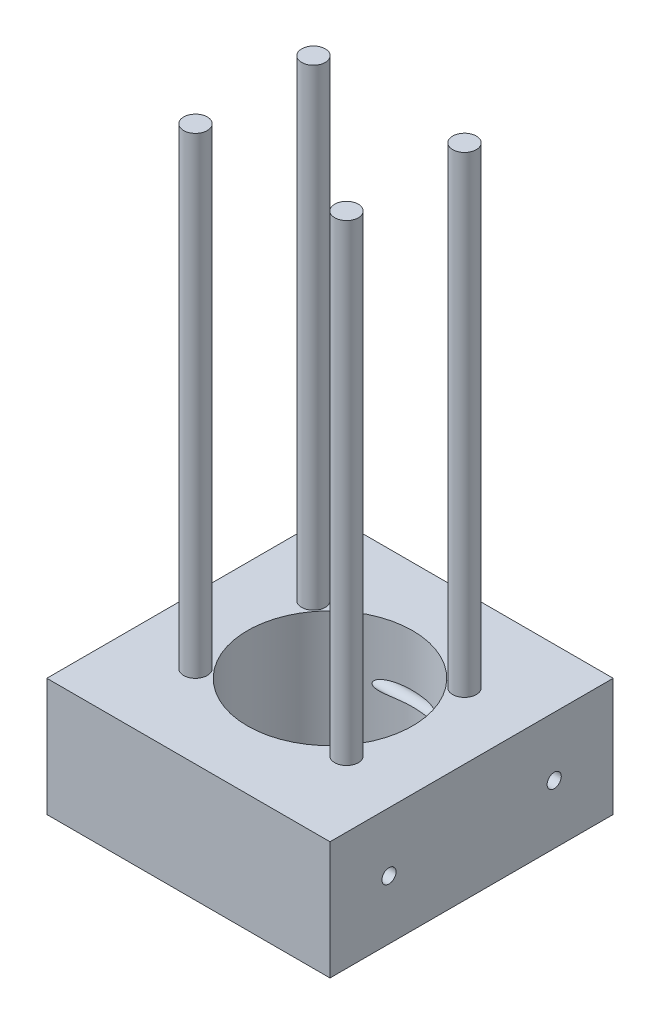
from build123d import *

# Parameters (mm, degrees)
ESQUISSE1_W             = 120
ESQUISSE1_H             = 50
BASE_EXTRUSION_DEPTH    = 120
ESQUISSE2_R             = 35
ENL_V_MAT_EXTRU_1_DEPTH = 177.91806013
ESQUISSE3_R             = 10
ENL_V_MAT_EXTRU_2_DEPTH = 8
ESQUISSE4_R             = 3
ENL_V_MAT_EXTRU_3_DEPTH = 172.59254063
ESQUISSE5_R             = 5
BOSS_EXTRU_1_DEPTH      = 200


with BuildPart() as part:
    # Esquisse1 → Base-Extrusion (new body)
    with BuildSketch(Plane.XY):
        with Locations((60, 25)):
            Rectangle(ESQUISSE1_W, ESQUISSE1_H)
    extrude(amount=BASE_EXTRUSION_DEPTH)

    # Esquisse2 → Enl_v. mat.-Extru.1 (cut, through all)
    with BuildSketch(Plane(origin=(0, 50, 0), x_dir=(-1, 0, 0), z_dir=(0, 1, 0))):
        with Locations(Location((-60, 60, 0), (0, 0, 90))):
            Circle(ESQUISSE2_R)
    extrude(amount=-ENL_V_MAT_EXTRU_1_DEPTH, mode=Mode.SUBTRACT)

    # Esquisse3 → Enl_v. mat.-Extru.2 (cut)
    with BuildSketch(Plane.ZY):
        with Locations((95, 25)):
            Circle(ESQUISSE3_R)
        with Locations(Location((25, 25, 0), (0, 0, 180))):
            Circle(ESQUISSE3_R)
    extrude(amount=-ENL_V_MAT_EXTRU_2_DEPTH, mode=Mode.SUBTRACT)

    # Esquisse4 → Enl_v. mat.-Extru.3 (cut, through all)
    with BuildSketch(Plane.ZY.offset(-8)):
        with Locations((25, 25)):
            Circle(ESQUISSE4_R)
        with Locations((95, 25)):
            Circle(ESQUISSE4_R)
    extrude(amount=-ENL_V_MAT_EXTRU_3_DEPTH, mode=Mode.SUBTRACT)

    # Esquisse5 → Boss.-Extru.1 (add)
    with BuildSketch(Plane(origin=(0, 50, 0), x_dir=(-1, 0, 0), z_dir=(0, 1, 0))):
        with Locations(Location((-92, 35, 0), (0, 0, 270))):
            Circle(ESQUISSE5_R)
        with Locations(Location((-92, 85, 0), (0, 0, 270))):
            Circle(ESQUISSE5_R)
        with Locations(Location((-28, 35, 0), (0, 0, 270))):
            Circle(ESQUISSE5_R)
        with Locations(Location((-28, 85, 0), (0, 0, 270))):
            Circle(ESQUISSE5_R)
    extrude(amount=BOSS_EXTRU_1_DEPTH)


solid = part.part
